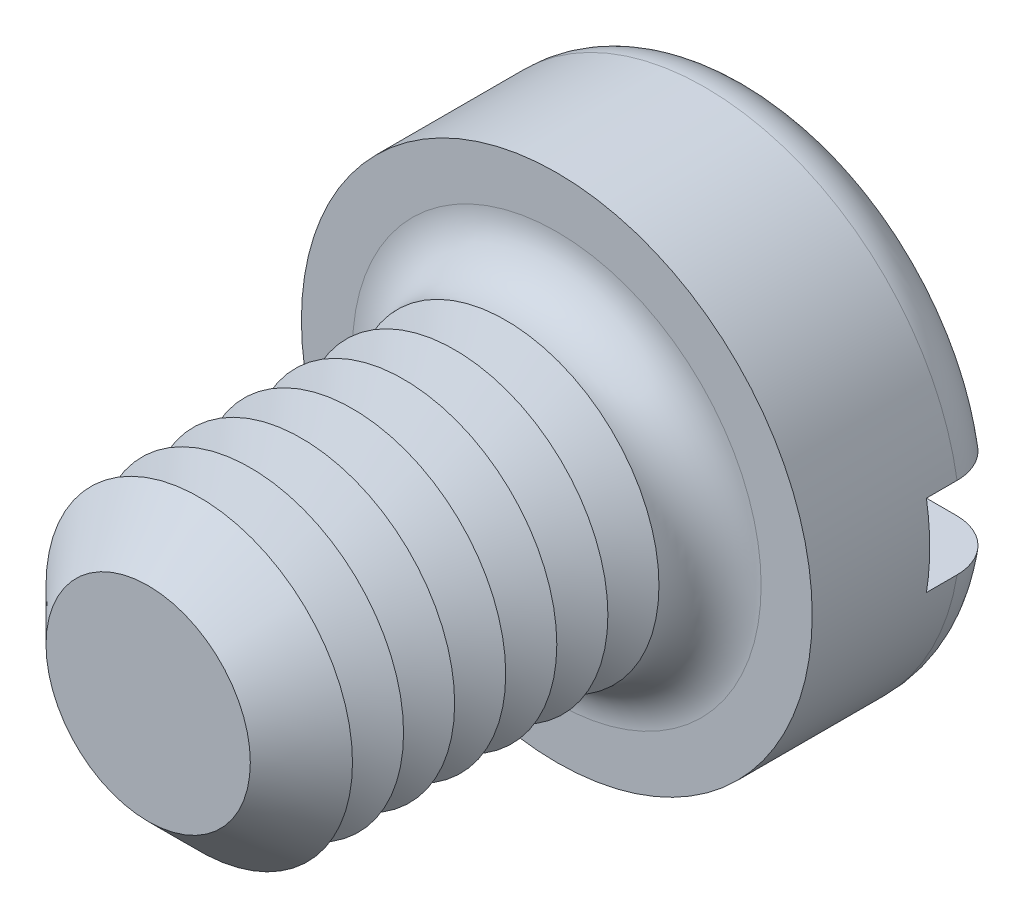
ISO-10303-21;
HEADER;
FILE_DESCRIPTION(('STEP AP214'),'2;1');
FILE_NAME('part.step','',(''),(''),'','','');
FILE_SCHEMA(('AUTOMOTIVE_DESIGN { 1 0 10303 214 1 1 1 1 }'));
ENDSEC;
DATA;
#1=APPLICATION_CONTEXT('core data for automotive mechanical design processes');
#2=APPLICATION_PROTOCOL_DEFINITION('international standard','automotive_design',2000,#1);
#3=PRODUCT_CONTEXT('',#1,'mechanical');
#4=PRODUCT('Part','Part','',(#3));
#5=PRODUCT_RELATED_PRODUCT_CATEGORY('part','',(#4));
#6=PRODUCT_DEFINITION_FORMATION('','',#4);
#7=PRODUCT_DEFINITION_CONTEXT('part definition',#1,'design');
#8=PRODUCT_DEFINITION('design','',#6,#7);
#9=PRODUCT_DEFINITION_SHAPE('','',#8);
#10=(LENGTH_UNIT() NAMED_UNIT(*) SI_UNIT(.MILLI.,.METRE.));
#11=(NAMED_UNIT(*) PLANE_ANGLE_UNIT() SI_UNIT($,.RADIAN.));
#12=(NAMED_UNIT(*) SI_UNIT($,.STERADIAN.) SOLID_ANGLE_UNIT());
#13=UNCERTAINTY_MEASURE_WITH_UNIT(LENGTH_MEASURE(1.E-05),#10,'distance_accuracy_value','');
#14=(GEOMETRIC_REPRESENTATION_CONTEXT(3) GLOBAL_UNCERTAINTY_ASSIGNED_CONTEXT((#13)) GLOBAL_UNIT_ASSIGNED_CONTEXT((#10,
#11,#12)) REPRESENTATION_CONTEXT('',''));
#15=CARTESIAN_POINT('',(0.,0.,0.));
#16=DIRECTION('',(0.,0.,1.));
#17=DIRECTION('',(1.,0.,0.));
#18=AXIS2_PLACEMENT_3D('',#15,#16,#17);
#19=CARTESIAN_POINT('',(0.,0.,-3.9));
#20=DIRECTION('',(0.,0.,1.));
#21=DIRECTION('',(1.,0.,0.));
#22=AXIS2_PLACEMENT_3D('',#19,#20,#21);
#23=PLANE('',#22);
#24=CARTESIAN_POINT('',(0.,0.,-3.9));
#25=DIRECTION('',(0.,0.,1.));
#26=DIRECTION('',(1.,0.,0.));
#27=AXIS2_PLACEMENT_3D('',#24,#25,#26);
#28=CIRCLE('',#27,4.);
#29=CARTESIAN_POINT('',(-3.91918358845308,0.800000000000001,-3.9));
#30=VERTEX_POINT('',#29);
#31=CARTESIAN_POINT('',(3.91918358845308,0.8,-3.9));
#32=VERTEX_POINT('',#31);
#33=EDGE_CURVE('E116',#30,#32,#28,.F.);
#34=ORIENTED_EDGE('',*,*,#33,.T.);
#35=DIRECTION('',(1.,0.,0.));
#36=VECTOR('',#35,1.);
#37=CARTESIAN_POINT('',(-5.,0.800000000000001,-3.9));
#38=LINE('',#37,#36);
#39=EDGE_CURVE('E111',#30,#32,#38,.T.);
#40=ORIENTED_EDGE('',*,*,#39,.F.);
#41=EDGE_LOOP('',(#34,#40));
#42=FACE_BOUND('',#41,.T.);
#43=ADVANCED_FACE('F39',(#42),#23,.F.);
#44=CARTESIAN_POINT('',(0.,0.,-2.9));
#45=DIRECTION('',(0.,0.,1.));
#46=DIRECTION('',(1.,0.,0.));
#47=AXIS2_PLACEMENT_3D('',#44,#45,#46);
#48=TOROIDAL_SURFACE('',#47,4.,1.);
#49=CARTESIAN_POINT('',(-4.76648512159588,0.800000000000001,-3.45304061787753));
#50=CARTESIAN_POINT('',(-4.73486405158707,0.800000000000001,-3.50001565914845));
#51=CARTESIAN_POINT('',(-4.69920787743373,0.800000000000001,-3.54432871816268));
#52=CARTESIAN_POINT('',(-4.62090302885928,0.800000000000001,-3.62634638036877));
#53=CARTESIAN_POINT('',(-4.57824494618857,0.800000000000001,-3.66404194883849));
#54=CARTESIAN_POINT('',(-4.48726975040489,0.800000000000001,-3.73172278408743));
#55=CARTESIAN_POINT('',(-4.43895902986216,0.800000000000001,-3.76171664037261));
#56=CARTESIAN_POINT('',(-4.33804923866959,0.800000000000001,-3.81326437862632));
#57=CARTESIAN_POINT('',(-4.2854512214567,0.800000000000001,-3.8348203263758));
#58=CARTESIAN_POINT('',(-4.17679895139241,0.800000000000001,-3.86918431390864));
#59=CARTESIAN_POINT('',(-4.12071163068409,0.800000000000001,-3.88188775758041));
#60=CARTESIAN_POINT('',(-4.00720729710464,0.800000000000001,-3.89785932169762));
#61=CARTESIAN_POINT('',(-3.94979011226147,0.800000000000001,-3.9011262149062));
#62=CARTESIAN_POINT('',(-3.83429042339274,0.800000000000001,-3.89816676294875));
#63=CARTESIAN_POINT('',(-3.77621176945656,0.800000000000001,-3.89178937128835));
#64=CARTESIAN_POINT('',(-3.66191938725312,0.800000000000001,-3.8694726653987));
#65=CARTESIAN_POINT('',(-3.60570580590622,0.800000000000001,-3.85353259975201));
#66=CARTESIAN_POINT('',(-3.49618749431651,0.800000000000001,-3.81233202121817));
#67=CARTESIAN_POINT('',(-3.44291561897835,0.800000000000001,-3.78698406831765));
#68=CARTESIAN_POINT('',(-3.34140774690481,0.800000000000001,-3.72766098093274));
#69=CARTESIAN_POINT('',(-3.29317182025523,0.800000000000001,-3.69368572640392));
#70=CARTESIAN_POINT('',(-3.20343355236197,0.800000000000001,-3.6182054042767));
#71=CARTESIAN_POINT('',(-3.16189680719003,0.800000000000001,-3.57674128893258));
#72=CARTESIAN_POINT('',(-3.08658236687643,0.800000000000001,-3.48727547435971));
#73=CARTESIAN_POINT('',(-3.05280364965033,0.800000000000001,-3.43927463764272));
#74=CARTESIAN_POINT('',(-2.99489532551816,0.800000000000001,-3.33932895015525));
#75=CARTESIAN_POINT('',(-2.97055012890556,0.800000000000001,-3.28750911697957));
#76=CARTESIAN_POINT('',(-2.93124252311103,0.800000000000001,-3.18042600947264));
#77=CARTESIAN_POINT('',(-2.91627793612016,0.800000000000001,-3.12516353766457));
#78=CARTESIAN_POINT('',(-2.89663075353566,0.800000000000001,-3.01470560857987));
#79=CARTESIAN_POINT('',(-2.89162828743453,0.800000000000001,-2.95956691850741));
#80=CARTESIAN_POINT('',(-2.89112479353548,0.800000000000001,-2.84924961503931));
#81=CARTESIAN_POINT('',(-2.89562264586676,0.800000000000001,-2.79407100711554));
#82=CARTESIAN_POINT('',(-2.91379565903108,0.800000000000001,-2.6861912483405));
#83=CARTESIAN_POINT('',(-2.92731815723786,0.800000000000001,-2.63346424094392));
#84=CARTESIAN_POINT('',(-2.96290888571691,0.800000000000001,-2.53098203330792));
#85=CARTESIAN_POINT('',(-2.98497757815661,0.800000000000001,-2.48122699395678));
#86=CARTESIAN_POINT('',(-3.03728055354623,0.800000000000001,-2.38535286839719));
#87=CARTESIAN_POINT('',(-3.06761989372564,0.800000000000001,-2.33929117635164));
#88=CARTESIAN_POINT('',(-3.13537950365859,0.800000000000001,-2.2527125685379));
#89=CARTESIAN_POINT('',(-3.17280082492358,0.800000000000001,-2.21219647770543));
#90=CARTESIAN_POINT('',(-3.2549164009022,0.800000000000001,-2.13651195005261));
#91=CARTESIAN_POINT('',(-3.29980186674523,0.800000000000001,-2.10155095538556));
#92=CARTESIAN_POINT('',(-3.39467666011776,0.800000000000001,-2.03942270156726));
#93=CARTESIAN_POINT('',(-3.44466673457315,0.800000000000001,-2.01225658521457));
#94=CARTESIAN_POINT('',(-3.5497933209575,0.800000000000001,-1.96576935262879));
#95=CARTESIAN_POINT('',(-3.60503228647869,0.800000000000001,-1.94667963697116));
#96=CARTESIAN_POINT('',(-3.71791613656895,0.800000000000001,-1.91794308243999));
#97=CARTESIAN_POINT('',(-3.77556119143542,0.800000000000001,-1.90829691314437));
#98=CARTESIAN_POINT('',(-3.89221522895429,0.800000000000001,-1.89869331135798));
#99=CARTESIAN_POINT('',(-3.9512319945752,0.800000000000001,-1.89882985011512));
#100=CARTESIAN_POINT('',(-4.06839541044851,0.800000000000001,-1.90907818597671));
#101=CARTESIAN_POINT('',(-4.12654207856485,0.800000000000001,-1.91918977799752));
#102=CARTESIAN_POINT('',(-4.23988103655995,0.800000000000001,-1.9490667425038));
#103=CARTESIAN_POINT('',(-4.29509069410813,0.800000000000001,-1.96876615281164));
#104=CARTESIAN_POINT('',(-4.40134194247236,0.800000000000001,-2.01729572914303));
#105=CARTESIAN_POINT('',(-4.45238383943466,0.800000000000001,-2.04612522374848));
#106=CARTESIAN_POINT('',(-4.54801343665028,0.800000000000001,-2.1116316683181));
#107=CARTESIAN_POINT('',(-4.59268768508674,0.800000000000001,-2.14818225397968));
#108=CARTESIAN_POINT('',(-4.67513924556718,0.800000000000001,-2.22837632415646));
#109=CARTESIAN_POINT('',(-4.71291715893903,0.800000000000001,-2.27201918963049));
#110=CARTESIAN_POINT('',(-4.77986554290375,0.800000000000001,-2.36439990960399));
#111=CARTESIAN_POINT('',(-4.80916462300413,0.800000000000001,-2.41304457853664));
#112=CARTESIAN_POINT('',(-4.85906149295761,0.800000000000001,-2.51460659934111));
#113=CARTESIAN_POINT('',(-4.8796602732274,0.800000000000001,-2.56752346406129));
#114=CARTESIAN_POINT('',(-4.9113264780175,0.800000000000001,-2.67542592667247));
#115=CARTESIAN_POINT('',(-4.92250819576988,0.800000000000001,-2.73037800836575));
#116=CARTESIAN_POINT('',(-4.93542682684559,0.800000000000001,-2.84139649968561));
#117=CARTESIAN_POINT('',(-4.93716171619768,0.800000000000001,-2.89746314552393));
#118=CARTESIAN_POINT('',(-4.93114851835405,0.800000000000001,-3.00876455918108));
#119=CARTESIAN_POINT('',(-4.92345325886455,0.800000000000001,-3.0640022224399));
#120=CARTESIAN_POINT('',(-4.8989032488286,0.800000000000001,-3.17235240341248));
#121=CARTESIAN_POINT('',(-4.88205998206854,0.800000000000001,-3.22546749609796));
#122=CARTESIAN_POINT('',(-4.84819200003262,0.800000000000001,-3.30764066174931));
#123=CARTESIAN_POINT('',(-4.83390853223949,0.800000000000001,-3.33785845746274));
#124=CARTESIAN_POINT('',(-4.80237957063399,0.800000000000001,-3.39670633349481));
#125=CARTESIAN_POINT('',(-4.78513409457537,0.800000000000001,-3.42533642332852));
#126=CARTESIAN_POINT('',(-4.76648512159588,0.800000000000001,-3.45304061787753));
#127=B_SPLINE_CURVE_WITH_KNOTS('',3,(#49,#50,#51,#52,#53,#54,#55,#56,#57,#58,#59,#60,#61,#62,
#63,#64,#65,#66,#67,#68,#69,#70,#71,#72,#73,#74,#75,#76,#77,#78,#79,#80,#81,#82,#83,#84,#85,#86,
#87,#88,#89,#90,#91,#92,#93,#94,#95,#96,#97,#98,#99,#100,#101,#102,#103,#104,#105,#106,#107,
#108,#109,#110,#111,#112,#113,#114,#115,#116,#117,#118,#119,#120,#121,#122,#123,#124,#125,#126),
.UNSPECIFIED.,.T.,.F.,(4,2,2,2,2,2,2,2,2,2,2,2,2,2,2,2,2,2,2,2,2,2,2,2,2,2,2,2,2,2,2,2,2,2,2,2,
2,2,4),(0.,0.169755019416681,0.339740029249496,0.509534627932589,0.67928763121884,
0.851013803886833,1.02276230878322,1.19722869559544,1.37170879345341,1.54785292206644,
1.72399950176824,1.89921049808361,2.07439839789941,2.24530597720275,2.41617386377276,
2.58146078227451,2.74672821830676,2.90926852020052,3.0718176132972,3.2365363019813,
3.40127946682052,3.57118676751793,3.74111896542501,3.91563534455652,4.09016409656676,
4.26636956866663,4.4425714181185,4.61757781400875,4.79257134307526,4.96489650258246,
5.13720662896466,5.30674670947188,5.47626748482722,5.64369988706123,5.81116816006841,
5.97770254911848,6.14402836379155,6.24414438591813,6.34425980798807),.UNSPECIFIED.);
#128=CARTESIAN_POINT('',(-4.93558507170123,0.800000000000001,-2.9));
#129=VERTEX_POINT('',#128);
#130=EDGE_CURVE('E226',#129,#30,#127,.T.);
#131=ORIENTED_EDGE('',*,*,#130,.F.);
#132=CARTESIAN_POINT('',(0.,0.,-2.9));
#133=DIRECTION('',(0.,0.,1.));
#134=DIRECTION('',(1.,0.,0.));
#135=AXIS2_PLACEMENT_3D('',#132,#133,#134);
#136=CIRCLE('',#135,5.);
#137=CARTESIAN_POINT('',(4.93558507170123,0.8,-2.9));
#138=VERTEX_POINT('',#137);
#139=EDGE_CURVE('E124',#138,#129,#136,.T.);
#140=ORIENTED_EDGE('',*,*,#139,.F.);
#141=CARTESIAN_POINT('',(2.98553785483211,0.8,-3.31649797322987));
#142=CARTESIAN_POINT('',(3.00991125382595,0.8,-3.36788093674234));
#143=CARTESIAN_POINT('',(3.03875556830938,0.8,-3.41719756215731));
#144=CARTESIAN_POINT('',(3.1043993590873,0.8,-3.51028676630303));
#145=CARTESIAN_POINT('',(3.1412115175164,0.8,-3.55405032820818));
#146=CARTESIAN_POINT('',(3.22153641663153,0.8,-3.63476402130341));
#147=CARTESIAN_POINT('',(3.26503706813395,0.8,-3.67172618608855));
#148=CARTESIAN_POINT('',(3.35749627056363,0.8,-3.73799476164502));
#149=CARTESIAN_POINT('',(3.4064533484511,0.8,-3.76730323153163));
#150=CARTESIAN_POINT('',(3.5095773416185,0.8,-3.81809642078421));
#151=CARTESIAN_POINT('',(3.56383317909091,0.8,-3.83940072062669));
#152=CARTESIAN_POINT('',(3.67513017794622,0.8,-3.87272481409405));
#153=CARTESIAN_POINT('',(3.7321717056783,0.8,-3.88474338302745));
#154=CARTESIAN_POINT('',(3.84815688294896,0.8,-3.89923413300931));
#155=CARTESIAN_POINT('',(3.90711516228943,0.8,-3.9015896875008));
#156=CARTESIAN_POINT('',(4.02458610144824,0.8,-3.89631753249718));
#157=CARTESIAN_POINT('',(4.08309876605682,0.8,-3.8886899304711));
#158=CARTESIAN_POINT('',(4.19768646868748,0.8,-3.86366584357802));
#159=CARTESIAN_POINT('',(4.25377243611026,0.8,-3.84631948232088));
#160=CARTESIAN_POINT('',(4.3621676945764,0.8,-3.80231797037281));
#161=CARTESIAN_POINT('',(4.41447726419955,0.8,-3.77566350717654));
#162=CARTESIAN_POINT('',(4.51300872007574,0.8,-3.71421163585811));
#163=CARTESIAN_POINT('',(4.5593085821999,0.8,-3.67953927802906));
#164=CARTESIAN_POINT('',(4.64530675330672,0.8,-3.60279495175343));
#165=CARTESIAN_POINT('',(4.68500564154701,0.8,-3.56072363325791));
#166=CARTESIAN_POINT('',(4.75599202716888,0.8,-3.47111750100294));
#167=CARTESIAN_POINT('',(4.7874061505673,0.8,-3.42368298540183));
#168=CARTESIAN_POINT('',(4.84170328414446,0.8,-3.32415927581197));
#169=CARTESIAN_POINT('',(4.86458695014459,0.8,-3.2720704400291));
#170=CARTESIAN_POINT('',(4.90088120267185,0.8,-3.16544016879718));
#171=CARTESIAN_POINT('',(4.91440984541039,0.8,-3.11093889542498));
#172=CARTESIAN_POINT('',(4.93205429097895,0.8,-3.00043391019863));
#173=CARTESIAN_POINT('',(4.93617053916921,0.8,-2.9444302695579));
#174=CARTESIAN_POINT('',(4.93486973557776,0.8,-2.83292218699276));
#175=CARTESIAN_POINT('',(4.92951827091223,0.8,-2.77741696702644));
#176=CARTESIAN_POINT('',(4.90957104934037,0.8,-2.66809456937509));
#177=CARTESIAN_POINT('',(4.89497541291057,0.8,-2.61427736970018));
#178=CARTESIAN_POINT('',(4.85697876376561,0.8,-2.50985095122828));
#179=CARTESIAN_POINT('',(4.83357805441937,0.8,-2.45924162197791));
#180=CARTESIAN_POINT('',(4.77866660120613,0.8,-2.36263484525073));
#181=CARTESIAN_POINT('',(4.74715567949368,0.8,-2.31663749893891));
#182=CARTESIAN_POINT('',(4.67670791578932,0.8,-2.23021464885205));
#183=CARTESIAN_POINT('',(4.6377224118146,0.8,-2.1898288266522));
#184=CARTESIAN_POINT('',(4.55359880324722,0.8,-2.11607828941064));
#185=CARTESIAN_POINT('',(4.50846036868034,0.8,-2.08271395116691));
#186=CARTESIAN_POINT('',(4.41271544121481,0.8,-2.02349513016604));
#187=CARTESIAN_POINT('',(4.36204749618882,0.8,-1.99774003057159));
#188=CARTESIAN_POINT('',(4.257155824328,0.8,-1.95495040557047));
#189=CARTESIAN_POINT('',(4.20293181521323,0.8,-1.93791657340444));
#190=CARTESIAN_POINT('',(4.09154156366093,0.8,-1.91276335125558));
#191=CARTESIAN_POINT('',(4.03434212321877,0.8,-1.90479098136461));
#192=CARTESIAN_POINT('',(3.91941228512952,0.8,-1.89840884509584));
#193=CARTESIAN_POINT('',(3.8616818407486,0.8,-1.89999992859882));
#194=CARTESIAN_POINT('',(3.7464111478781,0.8,-1.91275144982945));
#195=CARTESIAN_POINT('',(3.6888866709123,0.8,-1.92405471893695));
#196=CARTESIAN_POINT('',(3.57652290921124,0.8,-1.95609086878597));
#197=CARTESIAN_POINT('',(3.52168382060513,0.8,-1.97682443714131));
#198=CARTESIAN_POINT('',(3.41589179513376,0.8,-2.02733294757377));
#199=CARTESIAN_POINT('',(3.36496676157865,0.8,-2.05716640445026));
#200=CARTESIAN_POINT('',(3.26890903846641,0.8,-2.12504079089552));
#201=CARTESIAN_POINT('',(3.22377627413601,0.8,-2.16308161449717));
#202=CARTESIAN_POINT('',(3.141135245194,0.8,-2.24593284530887));
#203=CARTESIAN_POINT('',(3.1035541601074,0.8,-2.29067053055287));
#204=CARTESIAN_POINT('',(3.03669700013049,0.8,-2.38597317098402));
#205=CARTESIAN_POINT('',(3.00741914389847,0.8,-2.43653687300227));
#206=CARTESIAN_POINT('',(2.95891799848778,0.8,-2.54052959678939));
#207=CARTESIAN_POINT('',(2.93943249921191,0.8,-2.59383627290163));
#208=CARTESIAN_POINT('',(2.9100081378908,0.8,-2.70303736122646));
#209=CARTESIAN_POINT('',(2.90006970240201,0.8,-2.75893188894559));
#210=CARTESIAN_POINT('',(2.89027863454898,0.8,-2.86986958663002));
#211=CARTESIAN_POINT('',(2.89012791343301,0.8,-2.92488680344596));
#212=CARTESIAN_POINT('',(2.89917145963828,0.8,-3.03409648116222));
#213=CARTESIAN_POINT('',(2.90835313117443,0.8,-3.08828995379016));
#214=CARTESIAN_POINT('',(2.92977618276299,0.8,-3.17141652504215));
#215=CARTESIAN_POINT('',(2.93899011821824,0.8,-3.20116372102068));
#216=CARTESIAN_POINT('',(2.96020249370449,0.8,-3.25964614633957));
#217=CARTESIAN_POINT('',(2.97220082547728,0.8,-3.28838141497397));
#218=CARTESIAN_POINT('',(2.98553785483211,0.8,-3.31649797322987));
#219=B_SPLINE_CURVE_WITH_KNOTS('',3,(#141,#142,#143,#144,#145,#146,#147,#148,#149,#150,#151,
#152,#153,#154,#155,#156,#157,#158,#159,#160,#161,#162,#163,#164,#165,#166,#167,#168,#169,#170,
#171,#172,#173,#174,#175,#176,#177,#178,#179,#180,#181,#182,#183,#184,#185,#186,#187,#188,#189,
#190,#191,#192,#193,#194,#195,#196,#197,#198,#199,#200,#201,#202,#203,#204,#205,#206,#207,#208,
#209,#210,#211,#212,#213,#214,#215,#216,#217,#218),.UNSPECIFIED.,.T.,.F.,(4,2,2,2,2,2,2,2,2,2,2,
2,2,2,2,2,2,2,2,2,2,2,2,2,2,2,2,2,2,2,2,2,2,2,2,2,2,2,4),(0.,0.170493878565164,
0.341261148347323,0.511723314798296,0.682139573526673,0.856194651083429,1.03027268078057,
1.20644565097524,1.38261672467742,1.55788746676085,1.73314526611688,1.90583484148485,
2.07850925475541,2.24836742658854,2.41821253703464,2.58587311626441,2.75352576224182,
2.92002154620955,3.08651516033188,3.25300303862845,3.41949456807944,3.58710926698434,
3.75473295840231,3.92445790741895,4.09419634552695,4.26665110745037,4.43912119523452,
4.61417197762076,4.78923552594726,4.96544940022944,5.1416609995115,5.31608191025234,
5.49046537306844,5.65989063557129,5.82932346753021,5.99359365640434,6.157642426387,
6.250939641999,6.34423323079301),.UNSPECIFIED.);
#220=EDGE_CURVE('E228',#32,#138,#219,.T.);
#221=ORIENTED_EDGE('',*,*,#220,.F.);
#222=ORIENTED_EDGE('',*,*,#33,.F.);
#223=EDGE_LOOP('',(#131,#140,#221,#222));
#224=FACE_BOUND('',#223,.T.);
#225=ADVANCED_FACE('F210',(#224),#48,.T.);
#226=CARTESIAN_POINT('',(0.,0.,-3.9));
#227=DIRECTION('',(0.,0.,1.));
#228=DIRECTION('',(1.,0.,0.));
#229=AXIS2_PLACEMENT_3D('',#226,#227,#228);
#230=CYLINDRICAL_SURFACE('',#229,5.);
#231=DIRECTION('',(0.,0.,1.));
#232=VECTOR('',#231,1.);
#233=CARTESIAN_POINT('',(4.93558507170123,0.8,-3.9));
#234=LINE('',#233,#232);
#235=CARTESIAN_POINT('',(4.93558507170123,0.8,-2.3));
#236=VERTEX_POINT('',#235);
#237=EDGE_CURVE('E244',#138,#236,#234,.T.);
#238=ORIENTED_EDGE('',*,*,#237,.F.);
#239=ORIENTED_EDGE('',*,*,#139,.T.);
#240=DIRECTION('',(0.,0.,1.));
#241=VECTOR('',#240,1.);
#242=CARTESIAN_POINT('',(-4.93558507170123,0.800000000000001,-3.9));
#243=LINE('',#242,#241);
#244=CARTESIAN_POINT('',(-4.93558507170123,0.800000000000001,-2.3));
#245=VERTEX_POINT('',#244);
#246=EDGE_CURVE('E63',#245,#129,#243,.F.);
#247=ORIENTED_EDGE('',*,*,#246,.F.);
#248=CARTESIAN_POINT('',(0.,0.,-2.3));
#249=DIRECTION('',(0.,0.,-1.));
#250=DIRECTION('',(-1.,0.,0.));
#251=AXIS2_PLACEMENT_3D('',#248,#249,#250);
#252=CIRCLE('',#251,5.);
#253=CARTESIAN_POINT('',(-4.93558507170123,-0.799999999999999,-2.3));
#254=VERTEX_POINT('',#253);
#255=EDGE_CURVE('E43',#245,#254,#252,.F.);
#256=ORIENTED_EDGE('',*,*,#255,.T.);
#257=DIRECTION('',(0.,0.,1.));
#258=VECTOR('',#257,1.);
#259=CARTESIAN_POINT('',(-4.93558507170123,-0.799999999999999,-3.9));
#260=LINE('',#259,#258);
#261=CARTESIAN_POINT('',(-4.93558507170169,-0.799999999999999,-2.89999999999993));
#262=VERTEX_POINT('',#261);
#263=EDGE_CURVE('E241',#262,#254,#260,.T.);
#264=ORIENTED_EDGE('',*,*,#263,.F.);
#265=CARTESIAN_POINT('',(4.93558507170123,-0.8,-2.9));
#266=VERTEX_POINT('',#265);
#267=EDGE_CURVE('E126',#262,#266,#136,.T.);
#268=ORIENTED_EDGE('',*,*,#267,.T.);
#269=DIRECTION('',(0.,0.,1.));
#270=VECTOR('',#269,1.);
#271=CARTESIAN_POINT('',(4.93558507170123,-0.8,-3.9));
#272=LINE('',#271,#270);
#273=CARTESIAN_POINT('',(4.93558507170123,-0.8,-2.3));
#274=VERTEX_POINT('',#273);
#275=EDGE_CURVE('E55',#274,#266,#272,.F.);
#276=ORIENTED_EDGE('',*,*,#275,.F.);
#277=EDGE_CURVE('E11',#274,#236,#252,.F.);
#278=ORIENTED_EDGE('',*,*,#277,.T.);
#279=EDGE_LOOP('',(#238,#239,#247,#256,#264,#268,#276,#278));
#280=FACE_BOUND('',#279,.T.);
#281=CARTESIAN_POINT('',(0.,0.,0.));
#282=DIRECTION('',(0.,0.,1.));
#283=DIRECTION('',(1.,0.,0.));
#284=AXIS2_PLACEMENT_3D('',#281,#282,#283);
#285=CIRCLE('',#284,5.);
#286=CARTESIAN_POINT('',(5.,0.,0.));
#287=VERTEX_POINT('',#286);
#288=EDGE_CURVE('E247',#287,#287,#285,.T.);
#289=ORIENTED_EDGE('',*,*,#288,.F.);
#290=EDGE_LOOP('',(#289));
#291=FACE_BOUND('',#290,.T.);
#292=ADVANCED_FACE('F206',(#280,#291),#230,.T.);
#293=CARTESIAN_POINT('',(3.91918358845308,-0.8,-3.9));
#294=VERTEX_POINT('',#293);
#295=CARTESIAN_POINT('',(-3.91918358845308,-0.799999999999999,-3.9));
#296=VERTEX_POINT('',#295);
#297=EDGE_CURVE('E109',#294,#296,#28,.F.);
#298=ORIENTED_EDGE('',*,*,#297,.T.);
#299=DIRECTION('',(-1.,0.,0.));
#300=VECTOR('',#299,1.);
#301=CARTESIAN_POINT('',(-5.,-0.799999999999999,-3.9));
#302=LINE('',#301,#300);
#303=EDGE_CURVE('E96',#294,#296,#302,.T.);
#304=ORIENTED_EDGE('',*,*,#303,.F.);
#305=EDGE_LOOP('',(#298,#304));
#306=FACE_BOUND('',#305,.T.);
#307=ADVANCED_FACE('F108',(#306),#23,.F.);
#308=CARTESIAN_POINT('',(0.,0.,0.));
#309=DIRECTION('',(0.,0.,1.));
#310=DIRECTION('',(1.,0.,0.));
#311=AXIS2_PLACEMENT_3D('',#308,#309,#310);
#312=PLANE('',#311);
#313=CARTESIAN_POINT('',(0.,0.,0.));
#314=DIRECTION('',(0.,0.,1.));
#315=DIRECTION('',(1.,0.,0.));
#316=AXIS2_PLACEMENT_3D('',#313,#314,#315);
#317=CIRCLE('',#316,4.);
#318=CARTESIAN_POINT('',(4.,0.,0.));
#319=VERTEX_POINT('',#318);
#320=EDGE_CURVE('E115',#319,#319,#317,.F.);
#321=ORIENTED_EDGE('',*,*,#320,.T.);
#322=EDGE_LOOP('',(#321));
#323=FACE_BOUND('',#322,.T.);
#324=ORIENTED_EDGE('',*,*,#288,.T.);
#325=EDGE_LOOP('',(#324));
#326=FACE_BOUND('',#325,.T.);
#327=ADVANCED_FACE('F205',(#323,#326),#312,.T.);
#328=CARTESIAN_POINT('',(-4.76648512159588,-0.799999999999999,-3.45304061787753));
#329=CARTESIAN_POINT('',(-4.7975694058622,-0.799999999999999,-3.40685392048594));
#330=CARTESIAN_POINT('',(-4.82479903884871,-0.799999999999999,-3.35802740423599));
#331=CARTESIAN_POINT('',(-4.87070632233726,-0.799999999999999,-3.25646127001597));
#332=CARTESIAN_POINT('',(-4.8893747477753,-0.799999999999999,-3.20371750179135));
#333=CARTESIAN_POINT('',(-4.91756720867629,-0.799999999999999,-3.09584501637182));
#334=CARTESIAN_POINT('',(-4.92709302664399,-0.799999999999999,-3.04071676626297));
#335=CARTESIAN_POINT('',(-4.93671217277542,-0.799999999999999,-2.92965669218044));
#336=CARTESIAN_POINT('',(-4.93680767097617,-0.799999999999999,-2.87372505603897));
#337=CARTESIAN_POINT('',(-4.92758675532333,-0.799999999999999,-2.76284675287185));
#338=CARTESIAN_POINT('',(-4.91830421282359,-0.799999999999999,-2.70789726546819));
#339=CARTESIAN_POINT('',(-4.89065741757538,-0.799999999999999,-2.60033228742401));
#340=CARTESIAN_POINT('',(-4.87229291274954,-0.799999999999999,-2.54771686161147));
#341=CARTESIAN_POINT('',(-4.82699855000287,-0.799999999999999,-2.44622441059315));
#342=CARTESIAN_POINT('',(-4.80005659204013,-0.799999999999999,-2.39735278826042));
#343=CARTESIAN_POINT('',(-4.73841244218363,-0.799999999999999,-2.30477947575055));
#344=CARTESIAN_POINT('',(-4.70371003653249,-0.799999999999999,-2.26107792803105));
#345=CARTESIAN_POINT('',(-4.62724516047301,-0.799999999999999,-2.17969334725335));
#346=CARTESIAN_POINT('',(-4.58542787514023,-0.799999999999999,-2.14206183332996));
#347=CARTESIAN_POINT('',(-4.49614171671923,-0.799999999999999,-2.07424284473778));
#348=CARTESIAN_POINT('',(-4.44867251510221,-0.799999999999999,-2.04405580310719));
#349=CARTESIAN_POINT('',(-4.34875035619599,-0.799999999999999,-1.99153688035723));
#350=CARTESIAN_POINT('',(-4.29623870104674,-0.799999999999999,-1.96931670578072));
#351=CARTESIAN_POINT('',(-4.18826905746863,-0.799999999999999,-1.93384994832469));
#352=CARTESIAN_POINT('',(-4.1328108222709,-0.799999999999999,-1.92060411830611));
#353=CARTESIAN_POINT('',(-4.01956054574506,-0.799999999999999,-1.90323798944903));
#354=CARTESIAN_POINT('',(-3.96174522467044,-0.799999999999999,-1.89926947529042));
#355=CARTESIAN_POINT('',(-3.84625419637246,-0.799999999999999,-1.90095183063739));
#356=CARTESIAN_POINT('',(-3.78857850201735,-0.799999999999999,-1.90660355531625));
#357=CARTESIAN_POINT('',(-3.67415602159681,-0.799999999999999,-1.92748272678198));
#358=CARTESIAN_POINT('',(-3.61743328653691,-0.799999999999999,-1.94284216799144));
#359=CARTESIAN_POINT('',(-3.50734962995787,-0.799999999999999,-1.9828275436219));
#360=CARTESIAN_POINT('',(-3.4539889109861,-0.799999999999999,-2.00745403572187));
#361=CARTESIAN_POINT('',(-3.35197118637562,-0.799999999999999,-2.06542964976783));
#362=CARTESIAN_POINT('',(-3.30333217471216,-0.799999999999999,-2.0988104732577));
#363=CARTESIAN_POINT('',(-3.21244692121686,-0.799999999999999,-2.17337326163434));
#364=CARTESIAN_POINT('',(-3.17020039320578,-0.799999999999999,-2.21455487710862));
#365=CARTESIAN_POINT('',(-3.0940098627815,-0.799999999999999,-2.30296695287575));
#366=CARTESIAN_POINT('',(-3.05995540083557,-0.799999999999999,-2.35010211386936));
#367=CARTESIAN_POINT('',(-3.00053815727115,-0.799999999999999,-2.4495670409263));
#368=CARTESIAN_POINT('',(-2.97517362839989,-0.799999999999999,-2.50189576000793));
#369=CARTESIAN_POINT('',(-2.93470320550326,-0.799999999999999,-2.60853979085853));
#370=CARTESIAN_POINT('',(-2.91930557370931,-0.799999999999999,-2.66274437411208));
#371=CARTESIAN_POINT('',(-2.89812734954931,-0.799999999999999,-2.77299836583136));
#372=CARTESIAN_POINT('',(-2.89234481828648,-0.799999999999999,-2.82904740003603));
#373=CARTESIAN_POINT('',(-2.89064073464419,-0.799999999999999,-2.93970612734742));
#374=CARTESIAN_POINT('',(-2.89444549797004,-0.799999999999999,-2.99431180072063));
#375=CARTESIAN_POINT('',(-2.9112006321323,-0.799999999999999,-3.10209766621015));
#376=CARTESIAN_POINT('',(-2.9241507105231,-0.799999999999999,-3.1552779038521));
#377=CARTESIAN_POINT('',(-2.95868580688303,-0.799999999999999,-3.25858631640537));
#378=CARTESIAN_POINT('',(-2.98024709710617,-0.799999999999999,-3.30872244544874));
#379=CARTESIAN_POINT('',(-3.03128544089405,-0.799999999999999,-3.40478519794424));
#380=CARTESIAN_POINT('',(-3.06076335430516,-0.799999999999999,-3.45071136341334));
#381=CARTESIAN_POINT('',(-3.12753448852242,-0.799999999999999,-3.53826932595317));
#382=CARTESIAN_POINT('',(-3.16500083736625,-0.799999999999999,-3.57976901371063));
#383=CARTESIAN_POINT('',(-3.24617503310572,-0.799999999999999,-3.65613204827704));
#384=CARTESIAN_POINT('',(-3.28988388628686,-0.799999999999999,-3.69099432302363));
#385=CARTESIAN_POINT('',(-3.38380639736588,-0.799999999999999,-3.75424083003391));
#386=CARTESIAN_POINT('',(-3.43418287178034,-0.799999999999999,-3.78238342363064));
#387=CARTESIAN_POINT('',(-3.53887888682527,-0.799999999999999,-3.83000231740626));
#388=CARTESIAN_POINT('',(-3.59319889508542,-0.799999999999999,-3.84947758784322));
#389=CARTESIAN_POINT('',(-3.70539237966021,-0.799999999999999,-3.87954336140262));
#390=CARTESIAN_POINT('',(-3.76331464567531,-0.799999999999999,-3.88995217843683));
#391=CARTESIAN_POINT('',(-3.88008461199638,-0.799999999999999,-3.9009132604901));
#392=CARTESIAN_POINT('',(-3.93893230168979,-0.799999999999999,-3.9014656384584));
#393=CARTESIAN_POINT('',(-4.05594892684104,-0.799999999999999,-3.89264187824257));
#394=CARTESIAN_POINT('',(-4.11411702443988,-0.799999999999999,-3.88325457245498));
#395=CARTESIAN_POINT('',(-4.22802928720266,-0.799999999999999,-3.85472582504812));
#396=CARTESIAN_POINT('',(-4.28377297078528,-0.799999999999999,-3.83558245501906));
#397=CARTESIAN_POINT('',(-4.39054463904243,-0.799999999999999,-3.78829842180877));
#398=CARTESIAN_POINT('',(-4.44161887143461,-0.799999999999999,-3.76026208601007));
#399=CARTESIAN_POINT('',(-4.53818016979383,-0.799999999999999,-3.69589278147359));
#400=CARTESIAN_POINT('',(-4.58367442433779,-0.799999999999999,-3.65957066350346));
#401=CARTESIAN_POINT('',(-4.65208830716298,-0.799999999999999,-3.59453310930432));
#402=CARTESIAN_POINT('',(-4.67711825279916,-0.799999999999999,-3.56800018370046));
#403=CARTESIAN_POINT('',(-4.72414423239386,-0.799999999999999,-3.51236863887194));
#404=CARTESIAN_POINT('',(-4.74614029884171,-0.799999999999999,-3.48327004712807));
#405=CARTESIAN_POINT('',(-4.76648512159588,-0.799999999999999,-3.45304061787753));
#406=B_SPLINE_CURVE_WITH_KNOTS('',3,(#328,#329,#330,#331,#332,#333,#334,#335,#336,#337,#338,
#339,#340,#341,#342,#343,#344,#345,#346,#347,#348,#349,#350,#351,#352,#353,#354,#355,#356,#357,
#358,#359,#360,#361,#362,#363,#364,#365,#366,#367,#368,#369,#370,#371,#372,#373,#374,#375,#376,
#377,#378,#379,#380,#381,#382,#383,#384,#385,#386,#387,#388,#389,#390,#391,#392,#393,#394,#395,
#396,#397,#398,#399,#400,#401,#402,#403,#404,#405),.UNSPECIFIED.,.T.,.F.,(4,2,2,2,2,2,2,2,2,2,2,
2,2,2,2,2,2,2,2,2,2,2,2,2,2,2,2,2,2,2,2,2,2,2,2,2,2,2,4),(0.,0.166886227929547,
0.333951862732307,0.500984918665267,0.667979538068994,0.834373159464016,1.00077139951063,
1.16740542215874,1.33404403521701,1.50202999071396,1.67002571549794,1.84029248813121,
2.01057354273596,2.18362161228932,2.35668506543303,2.53215380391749,2.70763310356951,
2.88375684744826,3.05987270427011,3.23346085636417,3.40701408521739,3.57522519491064,
3.74340238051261,3.90683338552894,4.0702591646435,4.23323770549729,4.39623395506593,
4.56320691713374,4.7302068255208,4.90252468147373,5.07486300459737,5.25058028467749,
5.42629555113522,5.60220844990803,5.77815613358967,5.95211162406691,6.12584060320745,
6.23506966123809,6.34429754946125),.UNSPECIFIED.);
#407=EDGE_CURVE('E103',#296,#262,#406,.T.);
#408=ORIENTED_EDGE('',*,*,#407,.F.);
#409=ORIENTED_EDGE('',*,*,#297,.F.);
#410=CARTESIAN_POINT('',(2.98553785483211,-0.8,-3.31649797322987));
#411=CARTESIAN_POINT('',(2.96216773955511,-0.8,-3.26721849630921));
#412=CARTESIAN_POINT('',(2.94287503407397,-0.8,-3.21596872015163));
#413=CARTESIAN_POINT('',(2.91313258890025,-0.8,-3.11092723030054));
#414=CARTESIAN_POINT('',(2.9026902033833,-0.8,-3.0571334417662));
#415=CARTESIAN_POINT('',(2.89104377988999,-0.8,-2.94853922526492));
#416=CARTESIAN_POINT('',(2.88984130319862,-0.8,-2.89373862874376));
#417=CARTESIAN_POINT('',(2.89672585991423,-0.8,-2.78473646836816));
#418=CARTESIAN_POINT('',(2.90481120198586,-0.8,-2.73053479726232));
#419=CARTESIAN_POINT('',(2.92989134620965,-0.8,-2.62460092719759));
#420=CARTESIAN_POINT('',(2.94682969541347,-0.8,-2.57285532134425));
#421=CARTESIAN_POINT('',(2.9889990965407,-0.8,-2.47286425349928));
#422=CARTESIAN_POINT('',(3.01423103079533,-0.8,-2.42461916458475));
#423=CARTESIAN_POINT('',(3.07271536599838,-0.8,-2.33201565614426));
#424=CARTESIAN_POINT('',(3.10610710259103,-0.8,-2.28774532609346));
#425=CARTESIAN_POINT('',(3.17963417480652,-0.8,-2.205215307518));
#426=CARTESIAN_POINT('',(3.21977054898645,-0.8,-2.16695654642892));
#427=CARTESIAN_POINT('',(3.3070361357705,-0.8,-2.09624274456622));
#428=CARTESIAN_POINT('',(3.35434874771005,-0.8,-2.06401396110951));
#429=CARTESIAN_POINT('',(3.45361131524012,-0.8,-2.00773436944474));
#430=CARTESIAN_POINT('',(3.50556189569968,-0.8,-1.98368466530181));
#431=CARTESIAN_POINT('',(3.61398433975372,-0.8,-1.94389460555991));
#432=CARTESIAN_POINT('',(3.67053506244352,-0.8,-1.92836880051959));
#433=CARTESIAN_POINT('',(3.78543606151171,-0.8,-1.90696594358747));
#434=CARTESIAN_POINT('',(3.84378643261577,-0.8,-1.90108940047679));
#435=CARTESIAN_POINT('',(3.96100201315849,-0.8,-1.89918115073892));
#436=CARTESIAN_POINT('',(4.01986821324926,-0.8,-1.90320860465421));
#437=CARTESIAN_POINT('',(4.13606891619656,-0.8,-1.9211820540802));
#438=CARTESIAN_POINT('',(4.19340347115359,-0.8,-1.93512771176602));
#439=CARTESIAN_POINT('',(4.30434213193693,-0.8,-1.97243705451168));
#440=CARTESIAN_POINT('',(4.35797549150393,-0.8,-1.99571368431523));
#441=CARTESIAN_POINT('',(4.46048254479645,-0.8,-2.0510826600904));
#442=CARTESIAN_POINT('',(4.50935662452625,-0.8,-2.08317429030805));
#443=CARTESIAN_POINT('',(4.60012348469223,-0.8,-2.15471647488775));
#444=CARTESIAN_POINT('',(4.64211506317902,-0.8,-2.19404167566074));
#445=CARTESIAN_POINT('',(4.71877054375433,-0.8,-2.27928299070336));
#446=CARTESIAN_POINT('',(4.75343508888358,-0.8,-2.32519852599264));
#447=CARTESIAN_POINT('',(4.81388799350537,-0.8,-2.4215411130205));
#448=CARTESIAN_POINT('',(4.83980652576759,-0.8,-2.47188650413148));
#449=CARTESIAN_POINT('',(4.88271402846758,-0.8,-2.57624865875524));
#450=CARTESIAN_POINT('',(4.89970360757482,-0.8,-2.63026517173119));
#451=CARTESIAN_POINT('',(4.92409334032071,-0.8,-2.73978844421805));
#452=CARTESIAN_POINT('',(4.93159814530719,-0.8,-2.79527191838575));
#453=CARTESIAN_POINT('',(4.93713723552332,-0.8,-2.90670881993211));
#454=CARTESIAN_POINT('',(4.9351718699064,-0.8,-2.9626622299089));
#455=CARTESIAN_POINT('',(4.92186293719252,-0.8,-3.07317093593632));
#456=CARTESIAN_POINT('',(4.91056393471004,-0.8,-3.12773160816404));
#457=CARTESIAN_POINT('',(4.87898532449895,-0.8,-3.234187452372));
#458=CARTESIAN_POINT('',(4.85870572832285,-0.8,-3.28608262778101));
#459=CARTESIAN_POINT('',(4.80971634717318,-0.8,-3.38586723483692));
#460=CARTESIAN_POINT('',(4.78098824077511,-0.8,-3.43374766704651));
#461=CARTESIAN_POINT('',(4.71596686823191,-0.8,-3.52405937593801));
#462=CARTESIAN_POINT('',(4.67967336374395,-0.8,-3.56649048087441));
#463=CARTESIAN_POINT('',(4.60022577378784,-0.8,-3.64511036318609));
#464=CARTESIAN_POINT('',(4.5570143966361,-0.8,-3.6812412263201));
#465=CARTESIAN_POINT('',(4.4652099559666,-0.8,-3.7458530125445));
#466=CARTESIAN_POINT('',(4.41661654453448,-0.8,-3.77433344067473));
#467=CARTESIAN_POINT('',(4.31470683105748,-0.8,-3.82326981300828));
#468=CARTESIAN_POINT('',(4.26133399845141,-0.8,-3.84360800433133));
#469=CARTESIAN_POINT('',(4.15196444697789,-0.8,-3.87519515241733));
#470=CARTESIAN_POINT('',(4.09596750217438,-0.8,-3.88644332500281));
#471=CARTESIAN_POINT('',(3.98196469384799,-0.8,-3.89971870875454));
#472=CARTESIAN_POINT('',(3.92394096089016,-0.8,-3.901592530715));
#473=CARTESIAN_POINT('',(3.8083852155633,-0.8,-3.89570840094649));
#474=CARTESIAN_POINT('',(3.75085322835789,-0.8,-3.88794995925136));
#475=CARTESIAN_POINT('',(3.6371167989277,-0.8,-3.86287824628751));
#476=CARTESIAN_POINT('',(3.58093962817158,-0.8,-3.84544111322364));
#477=CARTESIAN_POINT('',(3.47227948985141,-0.8,-3.80139971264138));
#478=CARTESIAN_POINT('',(3.41979762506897,-0.8,-3.77479272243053));
#479=CARTESIAN_POINT('',(3.31994061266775,-0.8,-3.71304199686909));
#480=CARTESIAN_POINT('',(3.27257854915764,-0.8,-3.67787710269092));
#481=CARTESIAN_POINT('',(3.18459619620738,-0.8,-3.59999704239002));
#482=CARTESIAN_POINT('',(3.14396747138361,-0.8,-3.55729146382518));
#483=CARTESIAN_POINT('',(3.08341110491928,-0.8,-3.48140072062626));
#484=CARTESIAN_POINT('',(3.06118126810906,-0.8,-3.45002448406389));
#485=CARTESIAN_POINT('',(3.02047302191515,-0.8,-3.38492378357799));
#486=CARTESIAN_POINT('',(3.00199451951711,-0.8,-3.35119937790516));
#487=CARTESIAN_POINT('',(2.98553785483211,-0.8,-3.31649797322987));
#488=B_SPLINE_CURVE_WITH_KNOTS('',3,(#410,#411,#412,#413,#414,#415,#416,#417,#418,#419,#420,
#421,#422,#423,#424,#425,#426,#427,#428,#429,#430,#431,#432,#433,#434,#435,#436,#437,#438,#439,
#440,#441,#442,#443,#444,#445,#446,#447,#448,#449,#450,#451,#452,#453,#454,#455,#456,#457,#458,
#459,#460,#461,#462,#463,#464,#465,#466,#467,#468,#469,#470,#471,#472,#473,#474,#475,#476,#477,
#478,#479,#480,#481,#482,#483,#484,#485,#486,#487),.UNSPECIFIED.,.T.,.F.,(4,2,2,2,2,2,2,2,2,2,2,
2,2,2,2,2,2,2,2,2,2,2,2,2,2,2,2,2,2,2,2,2,2,2,2,2,2,2,4),(0.,0.163484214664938,
0.327104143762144,0.490751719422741,0.654369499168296,0.816956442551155,0.979560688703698,
1.14516376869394,1.31079237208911,1.48174839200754,1.6527274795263,1.82783306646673,
2.00294788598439,2.17911127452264,2.35526866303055,2.52981944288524,2.70435605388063,
2.87611266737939,3.04785420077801,3.21691347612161,3.38596122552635,3.55312700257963,
3.72028661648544,3.88665268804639,4.053018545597,4.2197478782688,4.38648246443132,
4.55467705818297,4.72288253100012,4.89343959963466,5.06401138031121,5.23736524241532,
5.41072792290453,5.58636211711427,5.76204850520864,5.93817375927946,6.11407667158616,
6.22920111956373,6.34432271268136),.UNSPECIFIED.);
#489=EDGE_CURVE('E92',#266,#294,#488,.T.);
#490=ORIENTED_EDGE('',*,*,#489,.F.);
#491=ORIENTED_EDGE('',*,*,#267,.F.);
#492=EDGE_LOOP('',(#408,#409,#490,#491));
#493=FACE_BOUND('',#492,.T.);
#494=ADVANCED_FACE('F113',(#493),#48,.T.);
#495=CARTESIAN_POINT('',(0.,0.,1.));
#496=DIRECTION('',(0.,0.,1.));
#497=DIRECTION('',(1.,0.,0.));
#498=AXIS2_PLACEMENT_3D('',#495,#496,#497);
#499=TOROIDAL_SURFACE('',#498,4.,1.);
#500=ORIENTED_EDGE('',*,*,#320,.F.);
#501=EDGE_LOOP('',(#500));
#502=FACE_BOUND('',#501,.T.);
#503=CARTESIAN_POINT('',(0.,0.,1.));
#504=DIRECTION('',(0.,0.,-1.));
#505=DIRECTION('',(-1.,0.,0.));
#506=AXIS2_PLACEMENT_3D('',#503,#504,#505);
#507=CIRCLE('',#506,3.);
#508=CARTESIAN_POINT('',(-3.,0.,1.));
#509=VERTEX_POINT('',#508);
#510=EDGE_CURVE('E252',#509,#509,#507,.T.);
#511=ORIENTED_EDGE('',*,*,#510,.T.);
#512=EDGE_LOOP('',(#511));
#513=FACE_BOUND('',#512,.T.);
#514=ADVANCED_FACE('F198',(#502,#513),#499,.F.);
#515=CARTESIAN_POINT('',(0.,0.,1.5));
#516=DIRECTION('',(0.,0.,-1.));
#517=DIRECTION('',(-1.,0.,0.));
#518=AXIS2_PLACEMENT_3D('',#515,#516,#517);
#519=CONICAL_SURFACE('',#518,2.13397459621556,1.0471975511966);
#520=ORIENTED_EDGE('',*,*,#510,.F.);
#521=EDGE_LOOP('',(#520));
#522=FACE_BOUND('',#521,.T.);
#523=CARTESIAN_POINT('',(0.,0.,1.5));
#524=DIRECTION('',(0.,0.,-1.));
#525=DIRECTION('',(-1.,0.,0.));
#526=AXIS2_PLACEMENT_3D('',#523,#524,#525);
#527=CIRCLE('',#526,2.13397459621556);
#528=CARTESIAN_POINT('',(-2.13397459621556,0.,1.5));
#529=VERTEX_POINT('',#528);
#530=EDGE_CURVE('E259',#529,#529,#527,.T.);
#531=ORIENTED_EDGE('',*,*,#530,.T.);
#532=EDGE_LOOP('',(#531));
#533=FACE_BOUND('',#532,.T.);
#534=ADVANCED_FACE('F194',(#522,#533),#519,.T.);
#535=CARTESIAN_POINT('',(0.,0.,2.));
#536=DIRECTION('',(0.,0.,1.));
#537=DIRECTION('',(1.,0.,0.));
#538=AXIS2_PLACEMENT_3D('',#535,#536,#537);
#539=CONICAL_SURFACE('',#538,3.,1.0471975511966);
#540=ORIENTED_EDGE('',*,*,#530,.F.);
#541=EDGE_LOOP('',(#540));
#542=FACE_BOUND('',#541,.T.);
#543=CARTESIAN_POINT('',(0.,0.,2.));
#544=DIRECTION('',(0.,0.,-1.));
#545=DIRECTION('',(-1.,0.,0.));
#546=AXIS2_PLACEMENT_3D('',#543,#544,#545);
#547=CIRCLE('',#546,3.);
#548=CARTESIAN_POINT('',(-3.,0.,2.));
#549=VERTEX_POINT('',#548);
#550=EDGE_CURVE('E265',#549,#549,#547,.T.);
#551=ORIENTED_EDGE('',*,*,#550,.T.);
#552=EDGE_LOOP('',(#551));
#553=FACE_BOUND('',#552,.T.);
#554=ADVANCED_FACE('F190',(#542,#553),#539,.T.);
#555=CARTESIAN_POINT('',(0.,0.,2.5));
#556=DIRECTION('',(0.,0.,-1.));
#557=DIRECTION('',(-1.,0.,0.));
#558=AXIS2_PLACEMENT_3D('',#555,#556,#557);
#559=CONICAL_SURFACE('',#558,2.13397459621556,1.0471975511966);
#560=ORIENTED_EDGE('',*,*,#550,.F.);
#561=EDGE_LOOP('',(#560));
#562=FACE_BOUND('',#561,.T.);
#563=CARTESIAN_POINT('',(0.,0.,2.5));
#564=DIRECTION('',(0.,0.,-1.));
#565=DIRECTION('',(-1.,0.,0.));
#566=AXIS2_PLACEMENT_3D('',#563,#564,#565);
#567=CIRCLE('',#566,2.13397459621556);
#568=CARTESIAN_POINT('',(-2.13397459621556,0.,2.5));
#569=VERTEX_POINT('',#568);
#570=EDGE_CURVE('E268',#569,#569,#567,.T.);
#571=ORIENTED_EDGE('',*,*,#570,.T.);
#572=EDGE_LOOP('',(#571));
#573=FACE_BOUND('',#572,.T.);
#574=ADVANCED_FACE('F186',(#562,#573),#559,.T.);
#575=CARTESIAN_POINT('',(0.,0.,3.));
#576=DIRECTION('',(0.,0.,1.));
#577=DIRECTION('',(1.,0.,0.));
#578=AXIS2_PLACEMENT_3D('',#575,#576,#577);
#579=CONICAL_SURFACE('',#578,3.,1.0471975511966);
#580=ORIENTED_EDGE('',*,*,#570,.F.);
#581=EDGE_LOOP('',(#580));
#582=FACE_BOUND('',#581,.T.);
#583=CARTESIAN_POINT('',(0.,0.,3.));
#584=DIRECTION('',(0.,0.,-1.));
#585=DIRECTION('',(-1.,0.,0.));
#586=AXIS2_PLACEMENT_3D('',#583,#584,#585);
#587=CIRCLE('',#586,3.);
#588=CARTESIAN_POINT('',(-3.,0.,3.));
#589=VERTEX_POINT('',#588);
#590=EDGE_CURVE('E272',#589,#589,#587,.T.);
#591=ORIENTED_EDGE('',*,*,#590,.T.);
#592=EDGE_LOOP('',(#591));
#593=FACE_BOUND('',#592,.T.);
#594=ADVANCED_FACE('F182',(#582,#593),#579,.T.);
#595=CARTESIAN_POINT('',(0.,0.,3.5));
#596=DIRECTION('',(0.,0.,-1.));
#597=DIRECTION('',(-1.,0.,0.));
#598=AXIS2_PLACEMENT_3D('',#595,#596,#597);
#599=CONICAL_SURFACE('',#598,2.13397459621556,1.0471975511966);
#600=ORIENTED_EDGE('',*,*,#590,.F.);
#601=EDGE_LOOP('',(#600));
#602=FACE_BOUND('',#601,.T.);
#603=CARTESIAN_POINT('',(0.,0.,3.5));
#604=DIRECTION('',(0.,0.,-1.));
#605=DIRECTION('',(-1.,0.,0.));
#606=AXIS2_PLACEMENT_3D('',#603,#604,#605);
#607=CIRCLE('',#606,2.13397459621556);
#608=CARTESIAN_POINT('',(-2.13397459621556,0.,3.5));
#609=VERTEX_POINT('',#608);
#610=EDGE_CURVE('E275',#609,#609,#607,.T.);
#611=ORIENTED_EDGE('',*,*,#610,.T.);
#612=EDGE_LOOP('',(#611));
#613=FACE_BOUND('',#612,.T.);
#614=ADVANCED_FACE('F178',(#602,#613),#599,.T.);
#615=CARTESIAN_POINT('',(0.,0.,4.));
#616=DIRECTION('',(0.,0.,1.));
#617=DIRECTION('',(1.,0.,0.));
#618=AXIS2_PLACEMENT_3D('',#615,#616,#617);
#619=CONICAL_SURFACE('',#618,3.,1.0471975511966);
#620=ORIENTED_EDGE('',*,*,#610,.F.);
#621=EDGE_LOOP('',(#620));
#622=FACE_BOUND('',#621,.T.);
#623=CARTESIAN_POINT('',(0.,0.,4.));
#624=DIRECTION('',(0.,0.,-1.));
#625=DIRECTION('',(-1.,0.,0.));
#626=AXIS2_PLACEMENT_3D('',#623,#624,#625);
#627=CIRCLE('',#626,3.);
#628=CARTESIAN_POINT('',(-3.,0.,4.));
#629=VERTEX_POINT('',#628);
#630=EDGE_CURVE('E278',#629,#629,#627,.T.);
#631=ORIENTED_EDGE('',*,*,#630,.T.);
#632=EDGE_LOOP('',(#631));
#633=FACE_BOUND('',#632,.T.);
#634=ADVANCED_FACE('F174',(#622,#633),#619,.T.);
#635=CARTESIAN_POINT('',(0.,0.,4.5));
#636=DIRECTION('',(0.,0.,-1.));
#637=DIRECTION('',(-1.,0.,0.));
#638=AXIS2_PLACEMENT_3D('',#635,#636,#637);
#639=CONICAL_SURFACE('',#638,2.13397459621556,1.0471975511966);
#640=ORIENTED_EDGE('',*,*,#630,.F.);
#641=EDGE_LOOP('',(#640));
#642=FACE_BOUND('',#641,.T.);
#643=CARTESIAN_POINT('',(0.,0.,4.5));
#644=DIRECTION('',(0.,0.,-1.));
#645=DIRECTION('',(-1.,0.,0.));
#646=AXIS2_PLACEMENT_3D('',#643,#644,#645);
#647=CIRCLE('',#646,2.13397459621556);
#648=CARTESIAN_POINT('',(-2.13397459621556,0.,4.5));
#649=VERTEX_POINT('',#648);
#650=EDGE_CURVE('E282',#649,#649,#647,.T.);
#651=ORIENTED_EDGE('',*,*,#650,.T.);
#652=EDGE_LOOP('',(#651));
#653=FACE_BOUND('',#652,.T.);
#654=ADVANCED_FACE('F170',(#642,#653),#639,.T.);
#655=CARTESIAN_POINT('',(0.,0.,5.));
#656=DIRECTION('',(0.,0.,1.));
#657=DIRECTION('',(1.,0.,0.));
#658=AXIS2_PLACEMENT_3D('',#655,#656,#657);
#659=CONICAL_SURFACE('',#658,3.,1.0471975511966);
#660=ORIENTED_EDGE('',*,*,#650,.F.);
#661=EDGE_LOOP('',(#660));
#662=FACE_BOUND('',#661,.T.);
#663=CARTESIAN_POINT('',(0.,0.,5.));
#664=DIRECTION('',(0.,0.,-1.));
#665=DIRECTION('',(-1.,0.,0.));
#666=AXIS2_PLACEMENT_3D('',#663,#664,#665);
#667=CIRCLE('',#666,3.);
#668=CARTESIAN_POINT('',(-3.,0.,5.));
#669=VERTEX_POINT('',#668);
#670=EDGE_CURVE('E286',#669,#669,#667,.T.);
#671=ORIENTED_EDGE('',*,*,#670,.T.);
#672=EDGE_LOOP('',(#671));
#673=FACE_BOUND('',#672,.T.);
#674=ADVANCED_FACE('F166',(#662,#673),#659,.T.);
#675=CARTESIAN_POINT('',(0.,0.,5.5));
#676=DIRECTION('',(0.,0.,-1.));
#677=DIRECTION('',(-1.,0.,0.));
#678=AXIS2_PLACEMENT_3D('',#675,#676,#677);
#679=CONICAL_SURFACE('',#678,2.13397459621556,1.0471975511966);
#680=ORIENTED_EDGE('',*,*,#670,.F.);
#681=EDGE_LOOP('',(#680));
#682=FACE_BOUND('',#681,.T.);
#683=CARTESIAN_POINT('',(0.,0.,5.5));
#684=DIRECTION('',(0.,0.,-1.));
#685=DIRECTION('',(-1.,0.,0.));
#686=AXIS2_PLACEMENT_3D('',#683,#684,#685);
#687=CIRCLE('',#686,2.13397459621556);
#688=CARTESIAN_POINT('',(-2.13397459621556,0.,5.5));
#689=VERTEX_POINT('',#688);
#690=EDGE_CURVE('E290',#689,#689,#687,.T.);
#691=ORIENTED_EDGE('',*,*,#690,.T.);
#692=EDGE_LOOP('',(#691));
#693=FACE_BOUND('',#692,.T.);
#694=ADVANCED_FACE('F162',(#682,#693),#679,.T.);
#695=CARTESIAN_POINT('',(0.,0.,6.));
#696=DIRECTION('',(0.,0.,1.));
#697=DIRECTION('',(1.,0.,0.));
#698=AXIS2_PLACEMENT_3D('',#695,#696,#697);
#699=CONICAL_SURFACE('',#698,3.,1.0471975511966);
#700=ORIENTED_EDGE('',*,*,#690,.F.);
#701=EDGE_LOOP('',(#700));
#702=FACE_BOUND('',#701,.T.);
#703=CARTESIAN_POINT('',(0.,0.,6.));
#704=DIRECTION('',(0.,0.,-1.));
#705=DIRECTION('',(-1.,0.,0.));
#706=AXIS2_PLACEMENT_3D('',#703,#704,#705);
#707=CIRCLE('',#706,3.);
#708=CARTESIAN_POINT('',(-3.,0.,6.));
#709=VERTEX_POINT('',#708);
#710=EDGE_CURVE('E293',#709,#709,#707,.T.);
#711=ORIENTED_EDGE('',*,*,#710,.T.);
#712=EDGE_LOOP('',(#711));
#713=FACE_BOUND('',#712,.T.);
#714=ADVANCED_FACE('F158',(#702,#713),#699,.T.);
#715=CARTESIAN_POINT('',(0.,0.,6.5));
#716=DIRECTION('',(0.,0.,-1.));
#717=DIRECTION('',(-1.,0.,0.));
#718=AXIS2_PLACEMENT_3D('',#715,#716,#717);
#719=CONICAL_SURFACE('',#718,2.13397459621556,1.0471975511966);
#720=ORIENTED_EDGE('',*,*,#710,.F.);
#721=EDGE_LOOP('',(#720));
#722=FACE_BOUND('',#721,.T.);
#723=CARTESIAN_POINT('',(0.,0.,6.5));
#724=DIRECTION('',(0.,0.,-1.));
#725=DIRECTION('',(-1.,0.,0.));
#726=AXIS2_PLACEMENT_3D('',#723,#724,#725);
#727=CIRCLE('',#726,2.13397459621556);
#728=CARTESIAN_POINT('',(-2.13397459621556,0.,6.5));
#729=VERTEX_POINT('',#728);
#730=EDGE_CURVE('E296',#729,#729,#727,.T.);
#731=ORIENTED_EDGE('',*,*,#730,.T.);
#732=EDGE_LOOP('',(#731));
#733=FACE_BOUND('',#732,.T.);
#734=ADVANCED_FACE('F154',(#722,#733),#719,.T.);
#735=CARTESIAN_POINT('',(0.,0.,7.));
#736=DIRECTION('',(0.,0.,1.));
#737=DIRECTION('',(1.,0.,0.));
#738=AXIS2_PLACEMENT_3D('',#735,#736,#737);
#739=CONICAL_SURFACE('',#738,3.,1.0471975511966);
#740=ORIENTED_EDGE('',*,*,#730,.F.);
#741=EDGE_LOOP('',(#740));
#742=FACE_BOUND('',#741,.T.);
#743=CARTESIAN_POINT('',(0.,0.,7.));
#744=DIRECTION('',(0.,0.,-1.));
#745=DIRECTION('',(-1.,0.,0.));
#746=AXIS2_PLACEMENT_3D('',#743,#744,#745);
#747=CIRCLE('',#746,3.);
#748=CARTESIAN_POINT('',(-3.,0.,7.));
#749=VERTEX_POINT('',#748);
#750=EDGE_CURVE('E300',#749,#749,#747,.T.);
#751=ORIENTED_EDGE('',*,*,#750,.T.);
#752=EDGE_LOOP('',(#751));
#753=FACE_BOUND('',#752,.T.);
#754=ADVANCED_FACE('F149',(#742,#753),#739,.T.);
#755=CARTESIAN_POINT('',(0.,0.,8.));
#756=DIRECTION('',(0.,0.,1.));
#757=DIRECTION('',(1.,0.,0.));
#758=AXIS2_PLACEMENT_3D('',#755,#756,#757);
#759=PLANE('',#758);
#760=CARTESIAN_POINT('',(0.,0.,8.));
#761=DIRECTION('',(0.,0.,1.));
#762=DIRECTION('',(1.,0.,0.));
#763=AXIS2_PLACEMENT_3D('',#760,#761,#762);
#764=CIRCLE('',#763,2.);
#765=CARTESIAN_POINT('',(2.,0.,8.));
#766=VERTEX_POINT('',#765);
#767=EDGE_CURVE('E104',#766,#766,#764,.T.);
#768=ORIENTED_EDGE('',*,*,#767,.T.);
#769=EDGE_LOOP('',(#768));
#770=FACE_BOUND('',#769,.T.);
#771=ADVANCED_FACE('F153',(#770),#759,.T.);
#772=CARTESIAN_POINT('',(0.,0.,8.));
#773=DIRECTION('',(0.,0.,-1.));
#774=DIRECTION('',(-1.,0.,0.));
#775=AXIS2_PLACEMENT_3D('',#772,#773,#774);
#776=CONICAL_SURFACE('',#775,2.,0.785398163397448);
#777=ORIENTED_EDGE('',*,*,#750,.F.);
#778=EDGE_LOOP('',(#777));
#779=FACE_BOUND('',#778,.T.);
#780=ORIENTED_EDGE('',*,*,#767,.F.);
#781=EDGE_LOOP('',(#780));
#782=FACE_BOUND('',#781,.T.);
#783=ADVANCED_FACE('F41',(#779,#782),#776,.T.);
#784=CARTESIAN_POINT('',(-5.,0.800000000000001,-2.3));
#785=DIRECTION('',(0.,1.,0.));
#786=DIRECTION('',(-1.,0.,0.));
#787=AXIS2_PLACEMENT_3D('',#784,#785,#786);
#788=PLANE('',#787);
#789=ORIENTED_EDGE('',*,*,#246,.T.);
#790=ORIENTED_EDGE('',*,*,#130,.T.);
#791=ORIENTED_EDGE('',*,*,#39,.T.);
#792=ORIENTED_EDGE('',*,*,#220,.T.);
#793=ORIENTED_EDGE('',*,*,#237,.T.);
#794=DIRECTION('',(1.,0.,0.));
#795=VECTOR('',#794,1.);
#796=CARTESIAN_POINT('',(-5.,0.800000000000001,-2.3));
#797=LINE('',#796,#795);
#798=EDGE_CURVE('E308',#245,#236,#797,.T.);
#799=ORIENTED_EDGE('',*,*,#798,.F.);
#800=EDGE_LOOP('',(#789,#790,#791,#792,#793,#799));
#801=FACE_BOUND('',#800,.T.);
#802=ADVANCED_FACE('F146',(#801),#788,.F.);
#803=CARTESIAN_POINT('',(-5.,-0.799999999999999,-2.3));
#804=DIRECTION('',(0.,-1.,0.));
#805=DIRECTION('',(1.,0.,0.));
#806=AXIS2_PLACEMENT_3D('',#803,#804,#805);
#807=PLANE('',#806);
#808=ORIENTED_EDGE('',*,*,#263,.T.);
#809=DIRECTION('',(-1.,0.,0.));
#810=VECTOR('',#809,1.);
#811=CARTESIAN_POINT('',(-5.,-0.799999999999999,-2.3));
#812=LINE('',#811,#810);
#813=EDGE_CURVE('E310',#274,#254,#812,.T.);
#814=ORIENTED_EDGE('',*,*,#813,.F.);
#815=ORIENTED_EDGE('',*,*,#275,.T.);
#816=ORIENTED_EDGE('',*,*,#489,.T.);
#817=ORIENTED_EDGE('',*,*,#303,.T.);
#818=ORIENTED_EDGE('',*,*,#407,.T.);
#819=EDGE_LOOP('',(#808,#814,#815,#816,#817,#818));
#820=FACE_BOUND('',#819,.T.);
#821=ADVANCED_FACE('F95',(#820),#807,.F.);
#822=CARTESIAN_POINT('',(0.,0.,-2.3));
#823=DIRECTION('',(0.,0.,-1.));
#824=DIRECTION('',(-1.,0.,0.));
#825=AXIS2_PLACEMENT_3D('',#822,#823,#824);
#826=PLANE('',#825);
#827=ORIENTED_EDGE('',*,*,#813,.T.);
#828=ORIENTED_EDGE('',*,*,#255,.F.);
#829=ORIENTED_EDGE('',*,*,#798,.T.);
#830=ORIENTED_EDGE('',*,*,#277,.F.);
#831=EDGE_LOOP('',(#827,#828,#829,#830));
#832=FACE_BOUND('',#831,.T.);
#833=ADVANCED_FACE('F145',(#832),#826,.T.);
#834=CLOSED_SHELL('',(#43,#225,#292,#307,#327,#494,#514,#534,#554,#574,#594,#614,#634,#654,#674,
#694,#714,#734,#754,#771,#783,#802,#821,#833));
#835=MANIFOLD_SOLID_BREP('B2',#834);
#836=ADVANCED_BREP_SHAPE_REPRESENTATION('',(#18,#835),#14);
#837=SHAPE_DEFINITION_REPRESENTATION(#9,#836);
ENDSEC;
END-ISO-10303-21;
